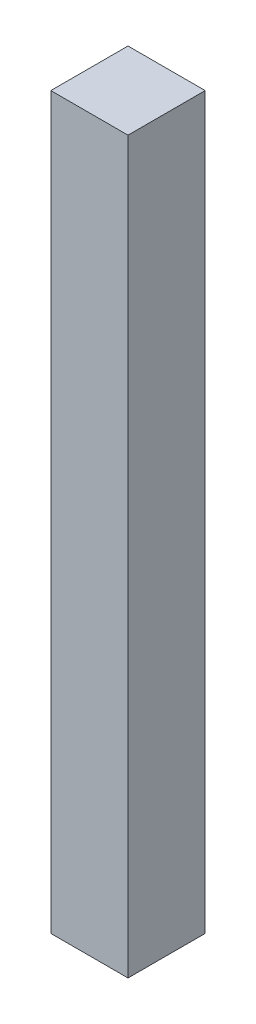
ISO-10303-21;
HEADER;
FILE_DESCRIPTION(('STEP AP214'),'2;1');
FILE_NAME('part.step','',(''),(''),'','','');
FILE_SCHEMA(('AUTOMOTIVE_DESIGN { 1 0 10303 214 1 1 1 1 }'));
ENDSEC;
DATA;
#1=APPLICATION_CONTEXT('core data for automotive mechanical design processes');
#2=APPLICATION_PROTOCOL_DEFINITION('international standard','automotive_design',2000,#1);
#3=PRODUCT_CONTEXT('',#1,'mechanical');
#4=PRODUCT('Part','Part','',(#3));
#5=PRODUCT_RELATED_PRODUCT_CATEGORY('part','',(#4));
#6=PRODUCT_DEFINITION_FORMATION('','',#4);
#7=PRODUCT_DEFINITION_CONTEXT('part definition',#1,'design');
#8=PRODUCT_DEFINITION('design','',#6,#7);
#9=PRODUCT_DEFINITION_SHAPE('','',#8);
#10=(LENGTH_UNIT() NAMED_UNIT(*) SI_UNIT(.MILLI.,.METRE.));
#11=(NAMED_UNIT(*) PLANE_ANGLE_UNIT() SI_UNIT($,.RADIAN.));
#12=(NAMED_UNIT(*) SI_UNIT($,.STERADIAN.) SOLID_ANGLE_UNIT());
#13=UNCERTAINTY_MEASURE_WITH_UNIT(LENGTH_MEASURE(1.E-05),#10,'distance_accuracy_value','');
#14=(GEOMETRIC_REPRESENTATION_CONTEXT(3) GLOBAL_UNCERTAINTY_ASSIGNED_CONTEXT((#13)) GLOBAL_UNIT_ASSIGNED_CONTEXT((#10,
#11,#12)) REPRESENTATION_CONTEXT('',''));
#15=CARTESIAN_POINT('',(0.,0.,0.));
#16=DIRECTION('',(0.,0.,1.));
#17=DIRECTION('',(1.,0.,0.));
#18=AXIS2_PLACEMENT_3D('',#15,#16,#17);
#19=CARTESIAN_POINT('',(69.85,1320.8,-69.85));
#20=DIRECTION('',(-1.,0.,0.));
#21=DIRECTION('',(0.,0.,1.));
#22=AXIS2_PLACEMENT_3D('',#19,#20,#21);
#23=PLANE('',#22);
#24=DIRECTION('',(0.,0.,-1.));
#25=VECTOR('',#24,1.);
#26=CARTESIAN_POINT('',(69.85,0.,-69.85));
#27=LINE('',#26,#25);
#28=CARTESIAN_POINT('',(69.85,0.,69.85));
#29=VERTEX_POINT('',#28);
#30=CARTESIAN_POINT('',(69.85,0.,-69.85));
#31=VERTEX_POINT('',#30);
#32=EDGE_CURVE('E103',#29,#31,#27,.T.);
#33=ORIENTED_EDGE('',*,*,#32,.T.);
#34=DIRECTION('',(0.,-1.,0.));
#35=VECTOR('',#34,1.);
#36=CARTESIAN_POINT('',(69.85,1320.8,-69.85));
#37=LINE('',#36,#35);
#38=CARTESIAN_POINT('',(69.85,1320.8,-69.85));
#39=VERTEX_POINT('',#38);
#40=EDGE_CURVE('E11',#39,#31,#37,.T.);
#41=ORIENTED_EDGE('',*,*,#40,.F.);
#42=DIRECTION('',(0.,0.,-1.));
#43=VECTOR('',#42,1.);
#44=CARTESIAN_POINT('',(69.85,1320.8,-69.85));
#45=LINE('',#44,#43);
#46=CARTESIAN_POINT('',(69.85,1320.8,69.85));
#47=VERTEX_POINT('',#46);
#48=EDGE_CURVE('E88',#47,#39,#45,.T.);
#49=ORIENTED_EDGE('',*,*,#48,.F.);
#50=DIRECTION('',(0.,-1.,0.));
#51=VECTOR('',#50,1.);
#52=CARTESIAN_POINT('',(69.85,1320.8,69.85));
#53=LINE('',#52,#51);
#54=EDGE_CURVE('E99',#47,#29,#53,.T.);
#55=ORIENTED_EDGE('',*,*,#54,.T.);
#56=EDGE_LOOP('',(#33,#41,#49,#55));
#57=FACE_BOUND('',#56,.T.);
#58=ADVANCED_FACE('F36',(#57),#23,.F.);
#59=CARTESIAN_POINT('',(-69.85,1320.8,-69.85));
#60=DIRECTION('',(0.,0.,1.));
#61=DIRECTION('',(1.,0.,0.));
#62=AXIS2_PLACEMENT_3D('',#59,#60,#61);
#63=PLANE('',#62);
#64=DIRECTION('',(-1.,0.,0.));
#65=VECTOR('',#64,1.);
#66=CARTESIAN_POINT('',(-69.85,0.,-69.85));
#67=LINE('',#66,#65);
#68=CARTESIAN_POINT('',(-69.85,0.,-69.85));
#69=VERTEX_POINT('',#68);
#70=EDGE_CURVE('E92',#31,#69,#67,.T.);
#71=ORIENTED_EDGE('',*,*,#70,.T.);
#72=DIRECTION('',(0.,-1.,0.));
#73=VECTOR('',#72,1.);
#74=CARTESIAN_POINT('',(-69.85,1320.8,-69.85));
#75=LINE('',#74,#73);
#76=CARTESIAN_POINT('',(-69.85,1320.8,-69.85));
#77=VERTEX_POINT('',#76);
#78=EDGE_CURVE('E44',#77,#69,#75,.T.);
#79=ORIENTED_EDGE('',*,*,#78,.F.);
#80=DIRECTION('',(-1.,0.,0.));
#81=VECTOR('',#80,1.);
#82=CARTESIAN_POINT('',(-69.85,1320.8,-69.85));
#83=LINE('',#82,#81);
#84=EDGE_CURVE('E83',#39,#77,#83,.T.);
#85=ORIENTED_EDGE('',*,*,#84,.F.);
#86=ORIENTED_EDGE('',*,*,#40,.T.);
#87=EDGE_LOOP('',(#71,#79,#85,#86));
#88=FACE_BOUND('',#87,.T.);
#89=ADVANCED_FACE('F91',(#88),#63,.F.);
#90=CARTESIAN_POINT('',(-69.85,1320.8,-69.85));
#91=DIRECTION('',(1.,0.,0.));
#92=DIRECTION('',(0.,0.,-1.));
#93=AXIS2_PLACEMENT_3D('',#90,#91,#92);
#94=PLANE('',#93);
#95=DIRECTION('',(0.,0.,1.));
#96=VECTOR('',#95,1.);
#97=CARTESIAN_POINT('',(-69.85,0.,-69.85));
#98=LINE('',#97,#96);
#99=CARTESIAN_POINT('',(-69.85,0.,69.85));
#100=VERTEX_POINT('',#99);
#101=EDGE_CURVE('E70',#69,#100,#98,.T.);
#102=ORIENTED_EDGE('',*,*,#101,.T.);
#103=DIRECTION('',(0.,-1.,0.));
#104=VECTOR('',#103,1.);
#105=CARTESIAN_POINT('',(-69.85,1320.8,69.85));
#106=LINE('',#105,#104);
#107=CARTESIAN_POINT('',(-69.85,1320.8,69.85));
#108=VERTEX_POINT('',#107);
#109=EDGE_CURVE('E93',#108,#100,#106,.T.);
#110=ORIENTED_EDGE('',*,*,#109,.F.);
#111=DIRECTION('',(0.,0.,1.));
#112=VECTOR('',#111,1.);
#113=CARTESIAN_POINT('',(-69.85,1320.8,-69.85));
#114=LINE('',#113,#112);
#115=EDGE_CURVE('E86',#77,#108,#114,.T.);
#116=ORIENTED_EDGE('',*,*,#115,.F.);
#117=ORIENTED_EDGE('',*,*,#78,.T.);
#118=EDGE_LOOP('',(#102,#110,#116,#117));
#119=FACE_BOUND('',#118,.T.);
#120=ADVANCED_FACE('F94',(#119),#94,.F.);
#121=CARTESIAN_POINT('',(-69.85,1320.8,69.85));
#122=DIRECTION('',(0.,0.,-1.));
#123=DIRECTION('',(-1.,0.,0.));
#124=AXIS2_PLACEMENT_3D('',#121,#122,#123);
#125=PLANE('',#124);
#126=DIRECTION('',(1.,0.,0.));
#127=VECTOR('',#126,1.);
#128=CARTESIAN_POINT('',(-69.85,0.,69.85));
#129=LINE('',#128,#127);
#130=EDGE_CURVE('E76',#100,#29,#129,.T.);
#131=ORIENTED_EDGE('',*,*,#130,.T.);
#132=ORIENTED_EDGE('',*,*,#54,.F.);
#133=DIRECTION('',(1.,0.,0.));
#134=VECTOR('',#133,1.);
#135=CARTESIAN_POINT('',(-69.85,1320.8,69.85));
#136=LINE('',#135,#134);
#137=EDGE_CURVE('E52',#108,#47,#136,.T.);
#138=ORIENTED_EDGE('',*,*,#137,.F.);
#139=ORIENTED_EDGE('',*,*,#109,.T.);
#140=EDGE_LOOP('',(#131,#132,#138,#139));
#141=FACE_BOUND('',#140,.T.);
#142=ADVANCED_FACE('F111',(#141),#125,.F.);
#143=CARTESIAN_POINT('',(69.85,1320.8,69.85));
#144=DIRECTION('',(0.,1.,0.));
#145=DIRECTION('',(0.,0.,1.));
#146=AXIS2_PLACEMENT_3D('',#143,#144,#145);
#147=PLANE('',#146);
#148=ORIENTED_EDGE('',*,*,#48,.T.);
#149=ORIENTED_EDGE('',*,*,#84,.T.);
#150=ORIENTED_EDGE('',*,*,#115,.T.);
#151=ORIENTED_EDGE('',*,*,#137,.T.);
#152=EDGE_LOOP('',(#148,#149,#150,#151));
#153=FACE_BOUND('',#152,.T.);
#154=ADVANCED_FACE('F84',(#153),#147,.T.);
#155=CARTESIAN_POINT('',(69.85,0.,69.85));
#156=DIRECTION('',(0.,1.,0.));
#157=DIRECTION('',(0.,0.,1.));
#158=AXIS2_PLACEMENT_3D('',#155,#156,#157);
#159=PLANE('',#158);
#160=ORIENTED_EDGE('',*,*,#32,.F.);
#161=ORIENTED_EDGE('',*,*,#130,.F.);
#162=ORIENTED_EDGE('',*,*,#101,.F.);
#163=ORIENTED_EDGE('',*,*,#70,.F.);
#164=EDGE_LOOP('',(#160,#161,#162,#163));
#165=FACE_BOUND('',#164,.T.);
#166=ADVANCED_FACE('F114',(#165),#159,.F.);
#167=CLOSED_SHELL('',(#58,#89,#120,#142,#154,#166));
#168=MANIFOLD_SOLID_BREP('B2',#167);
#169=ADVANCED_BREP_SHAPE_REPRESENTATION('',(#18,#168),#14);
#170=SHAPE_DEFINITION_REPRESENTATION(#9,#169);
ENDSEC;
END-ISO-10303-21;
